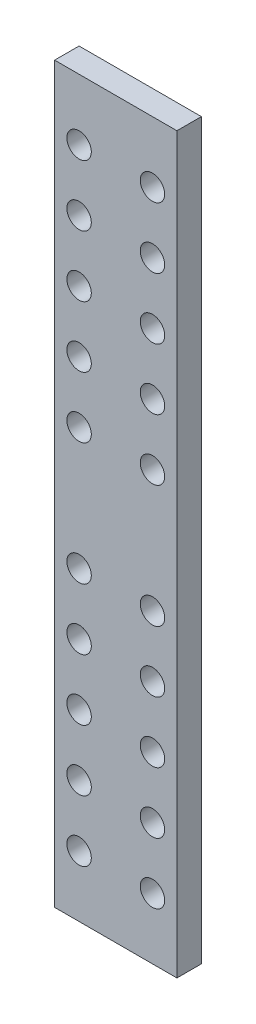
from build123d import *

# Parameters (mm, degrees)
SKETCH1_W              = 50
SKETCH1_H              = 300
BOSS_EXTRUDE1_DEPTH    = 10
F_10_0MM_DOWEL_HOLE1_D = 10
MIRROR2_COPY_1_D       = 10


with BuildPart() as part:
    # Sketch1 → Boss-Extrude1 (new body)
    with BuildSketch(Plane.XY):
        Rectangle(SKETCH1_W, SKETCH1_H)
    extrude(amount=BOSS_EXTRUDE1_DEPTH)

    # 10.0mm Dowel Hole1 (through all)
    with Locations(Plane.XY.offset(10)):
        with Locations((-15, 125), (-15, 100), (-15, 75), (-15, 50), (-15, 25)):
            f_10_0mm_dowel_hole1 = Hole(F_10_0MM_DOWEL_HOLE1_D / 2)

    # Mirror1: 10.0mm Dowel Hole1 across plane
    add(f_10_0mm_dowel_hole1.mirror(Plane(origin=(0, 0, 0), x_dir=(0, 0, 1), z_dir=(1, 0, 0))), mode=Mode.SUBTRACT)

    # Mirror2: 10.0mm Dowel Hole1 across plane
    add(f_10_0mm_dowel_hole1.mirror(Plane.ZX), mode=Mode.SUBTRACT)

    # Mirror2 copy 1 (through all)
    with Locations(Plane(origin=(0, 0, 10), x_dir=(-1, 0, 0), z_dir=(0, 0, 1))):
        with Locations((-15, 125), (-15, 100), (-15, 75), (-15, 50), (-15, 25)):
            Hole(MIRROR2_COPY_1_D / 2)


solid = part.part
